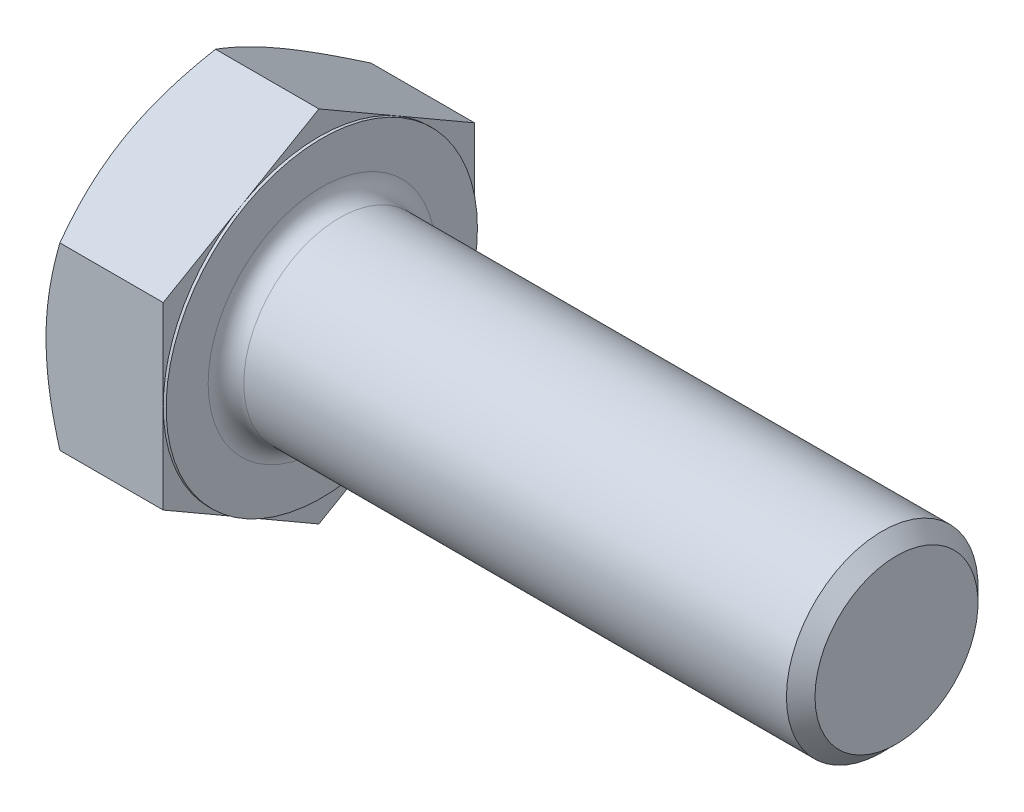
from build123d import *

# Parameters (mm, degrees)
BASEHEAD_DEPTH = 15.9258
SKETCH4_W      = 0.381
SKETCH4_H      = 28.592632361
HEADFILLET_R   = 2.3622


with BuildPart() as part:
    # Sketch1 → BaseHead (new body)
    with BuildSketch(Plane(origin=(0, 0, 0), x_dir=(0, 0, -1), z_dir=(1, 0, 0))):
        Polygon((20.6375, 11.91506618), (20.6375, -11.91506618), (0, -23.830132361), (-20.6375, -11.91506618), (-20.6375, 11.91506618), (0, 23.830132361), align=None)
    extrude(amount=BASEHEAD_DEPTH)

    # BodySke → BaseBody (revolve)
    with BuildSketch(Plane.XY, mode=Mode.PRIVATE) as basebody_sk:
        Polygon((0, 0), (92.1258, 0), (92.1258, 10.8077), (90.2335, 12.7), (0, 12.7), align=None)
    revolve(basebody_sk.sketch.rotate(Axis((0, 0, 0), (1, 0, 0)), 90), axis=Axis((0, 0, 0), (1, 0, 0)))

    # Sketch3 → HeadChamfer (revolve, cut)
    with BuildSketch(Plane.XY):
        Polygon((0, 20.6375), (5.509441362, 30.180132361), (5.509441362, 36.530132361), (-12.7, 36.530132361), (-12.7, 20.6375), align=None)
    revolve(axis=Axis((0, 0, 0), (1, 0, 0)), mode=Mode.SUBTRACT)

    # Sketch4 → BearingFace (revolve, cut)
    with BuildSketch(Plane.XY, mode=Mode.PRIVATE) as bearingface_sk:
        with Locations((15.7353, 34.933816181)):
            Rectangle(SKETCH4_W, SKETCH4_H)
    revolve(bearingface_sk.sketch.rotate(Axis((0, 0, 0), (1, 0, 0)), 270), axis=Axis((0, 0, 0), (1, 0, 0)), mode=Mode.SUBTRACT)

    # HeadFillet
    headfillet_edges = [part.edges().sort_by_distance(p)[0] for p in [
        (15.9258, 0, -12.7),
    ]]
    fillet(headfillet_edges, radius=HEADFILLET_R)


solid = part.part
